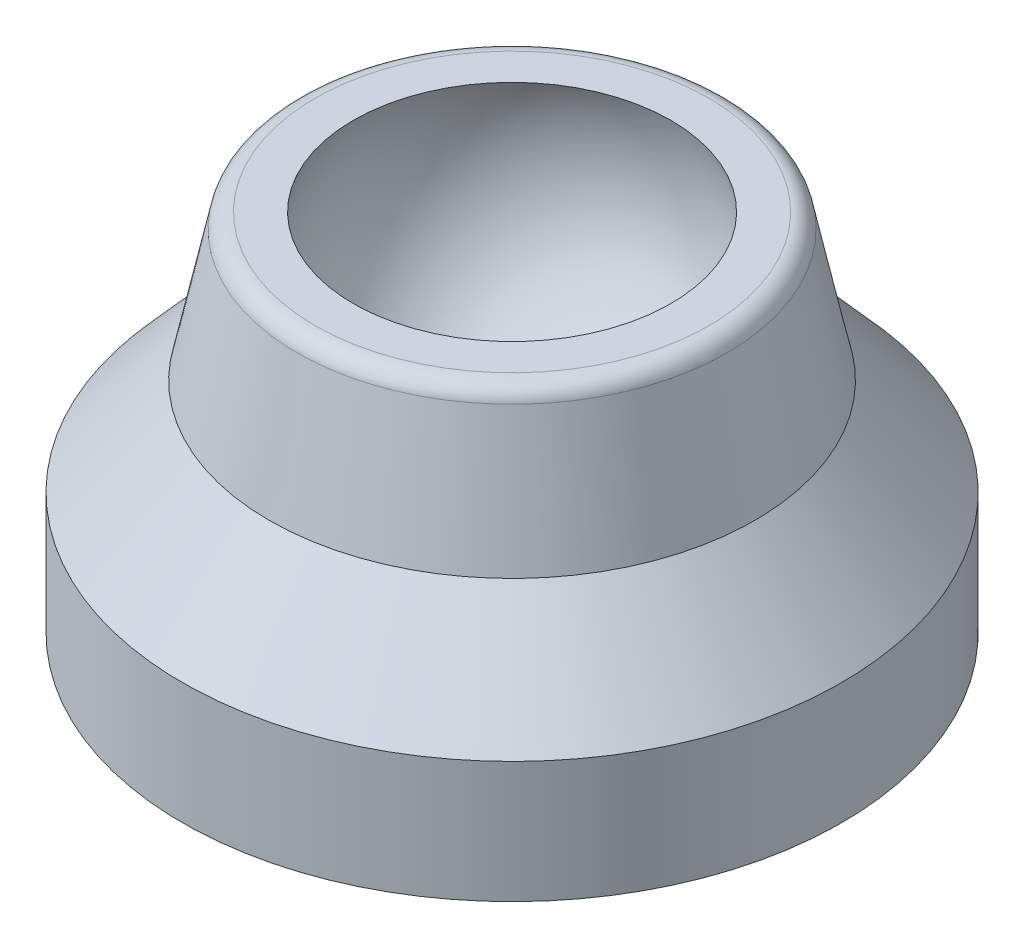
ISO-10303-21;
HEADER;
FILE_DESCRIPTION(('STEP AP214'),'2;1');
FILE_NAME('part.step','',(''),(''),'','','');
FILE_SCHEMA(('AUTOMOTIVE_DESIGN { 1 0 10303 214 1 1 1 1 }'));
ENDSEC;
DATA;
#1=APPLICATION_CONTEXT('core data for automotive mechanical design processes');
#2=APPLICATION_PROTOCOL_DEFINITION('international standard','automotive_design',2000,#1);
#3=PRODUCT_CONTEXT('',#1,'mechanical');
#4=PRODUCT('Part','Part','',(#3));
#5=PRODUCT_RELATED_PRODUCT_CATEGORY('part','',(#4));
#6=PRODUCT_DEFINITION_FORMATION('','',#4);
#7=PRODUCT_DEFINITION_CONTEXT('part definition',#1,'design');
#8=PRODUCT_DEFINITION('design','',#6,#7);
#9=PRODUCT_DEFINITION_SHAPE('','',#8);
#10=(LENGTH_UNIT() NAMED_UNIT(*) SI_UNIT(.MILLI.,.METRE.));
#11=(NAMED_UNIT(*) PLANE_ANGLE_UNIT() SI_UNIT($,.RADIAN.));
#12=(NAMED_UNIT(*) SI_UNIT($,.STERADIAN.) SOLID_ANGLE_UNIT());
#13=UNCERTAINTY_MEASURE_WITH_UNIT(LENGTH_MEASURE(1.E-05),#10,'distance_accuracy_value','');
#14=(GEOMETRIC_REPRESENTATION_CONTEXT(3) GLOBAL_UNCERTAINTY_ASSIGNED_CONTEXT((#13)) GLOBAL_UNIT_ASSIGNED_CONTEXT((#10,
#11,#12)) REPRESENTATION_CONTEXT('',''));
#15=CARTESIAN_POINT('',(0.,0.,0.));
#16=DIRECTION('',(0.,0.,1.));
#17=DIRECTION('',(1.,0.,0.));
#18=AXIS2_PLACEMENT_3D('',#15,#16,#17);
#19=CARTESIAN_POINT('',(0.,-5.25,0.));
#20=DIRECTION('',(0.,-1.,0.));
#21=DIRECTION('',(-1.,0.,0.));
#22=AXIS2_PLACEMENT_3D('',#19,#20,#21);
#23=SPHERICAL_SURFACE('',#22,4.9);
#24=CARTESIAN_POINT('',(0.,-3.5,0.));
#25=DIRECTION('',(0.,-1.,0.));
#26=DIRECTION('',(0.,0.,-1.));
#27=AXIS2_PLACEMENT_3D('',#24,#25,#26);
#28=CIRCLE('',#27,4.57684389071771);
#29=CARTESIAN_POINT('',(0.,-3.5,-4.57684389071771));
#30=VERTEX_POINT('',#29);
#31=EDGE_CURVE('E38',#30,#30,#28,.T.);
#32=ORIENTED_EDGE('',*,*,#31,.F.);
#33=EDGE_LOOP('',(#32));
#34=FACE_BOUND('',#33,.T.);
#35=ADVANCED_FACE('F15',(#34),#23,.F.);
#36=CARTESIAN_POINT('',(4.5768438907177,-3.5,0.));
#37=DIRECTION('',(0.,-1.,0.));
#38=DIRECTION('',(0.,0.,-1.));
#39=AXIS2_PLACEMENT_3D('',#36,#37,#38);
#40=PLANE('',#39);
#41=CARTESIAN_POINT('',(0.,-3.5,0.));
#42=DIRECTION('',(0.,-1.,0.));
#43=DIRECTION('',(0.,0.,-1.));
#44=AXIS2_PLACEMENT_3D('',#41,#42,#43);
#45=CIRCLE('',#44,5.67869842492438);
#46=CARTESIAN_POINT('',(0.,-3.5,-5.67869842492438));
#47=VERTEX_POINT('',#46);
#48=EDGE_CURVE('E35',#47,#47,#45,.T.);
#49=ORIENTED_EDGE('',*,*,#48,.F.);
#50=EDGE_LOOP('',(#49));
#51=FACE_BOUND('',#50,.T.);
#52=ORIENTED_EDGE('',*,*,#31,.T.);
#53=EDGE_LOOP('',(#52));
#54=FACE_BOUND('',#53,.T.);
#55=ADVANCED_FACE('F42',(#51,#54),#40,.F.);
#56=CARTESIAN_POINT('',(0.,-4.02999999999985,0.));
#57=DIRECTION('',(0.,-1.,0.));
#58=DIRECTION('',(0.,0.,-1.));
#59=AXIS2_PLACEMENT_3D('',#56,#57,#58);
#60=TOROIDAL_SURFACE('',#59,5.67869842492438,0.529999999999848);
#61=ORIENTED_EDGE('',*,*,#48,.T.);
#62=EDGE_LOOP('',(#61));
#63=FACE_BOUND('',#62,.T.);
#64=CARTESIAN_POINT('',(0.,-3.9198883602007,0.));
#65=DIRECTION('',(0.,-1.,0.));
#66=DIRECTION('',(0.,0.,-1.));
#67=AXIS2_PLACEMENT_3D('',#64,#65,#66);
#68=CIRCLE('',#67,6.1971339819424);
#69=CARTESIAN_POINT('',(0.,-3.9198883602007,-6.1971339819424));
#70=VERTEX_POINT('',#69);
#71=EDGE_CURVE('E30',#70,#70,#68,.T.);
#72=ORIENTED_EDGE('',*,*,#71,.F.);
#73=EDGE_LOOP('',(#72));
#74=FACE_BOUND('',#73,.T.);
#75=ADVANCED_FACE('F50',(#63,#74),#60,.T.);
#76=CARTESIAN_POINT('',(0.,-3.9198883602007,0.));
#77=DIRECTION('',(0.,-1.,0.));
#78=DIRECTION('',(0.,0.,-1.));
#79=AXIS2_PLACEMENT_3D('',#76,#77,#78);
#80=CONICAL_SURFACE('',#79,6.1971339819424,0.209282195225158);
#81=CARTESIAN_POINT('',(0.,-7.7,0.));
#82=DIRECTION('',(0.,-1.,0.));
#83=DIRECTION('',(0.,0.,-1.));
#84=AXIS2_PLACEMENT_3D('',#81,#82,#83);
#85=CIRCLE('',#84,7.);
#86=CARTESIAN_POINT('',(0.,-7.7,-7.));
#87=VERTEX_POINT('',#86);
#88=EDGE_CURVE('E26',#87,#87,#85,.T.);
#89=ORIENTED_EDGE('',*,*,#88,.F.);
#90=EDGE_LOOP('',(#89));
#91=FACE_BOUND('',#90,.T.);
#92=ORIENTED_EDGE('',*,*,#71,.T.);
#93=EDGE_LOOP('',(#92));
#94=FACE_BOUND('',#93,.T.);
#95=ADVANCED_FACE('F56',(#91,#94),#80,.T.);
#96=CARTESIAN_POINT('',(0.,-7.7,0.));
#97=DIRECTION('',(0.,-1.,0.));
#98=DIRECTION('',(0.,0.,-1.));
#99=AXIS2_PLACEMENT_3D('',#96,#97,#98);
#100=CONICAL_SURFACE('',#99,7.,0.72885472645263);
#101=CARTESIAN_POINT('',(0.,-10.5,0.));
#102=DIRECTION('',(0.,-1.,0.));
#103=DIRECTION('',(0.,0.,-1.));
#104=AXIS2_PLACEMENT_3D('',#101,#102,#103);
#105=CIRCLE('',#104,9.5);
#106=CARTESIAN_POINT('',(0.,-10.5,-9.5));
#107=VERTEX_POINT('',#106);
#108=EDGE_CURVE('E22',#107,#107,#105,.T.);
#109=ORIENTED_EDGE('',*,*,#108,.F.);
#110=EDGE_LOOP('',(#109));
#111=FACE_BOUND('',#110,.T.);
#112=ORIENTED_EDGE('',*,*,#88,.T.);
#113=EDGE_LOOP('',(#112));
#114=FACE_BOUND('',#113,.T.);
#115=ADVANCED_FACE('F60',(#111,#114),#100,.T.);
#116=CARTESIAN_POINT('',(0.,-14.,0.));
#117=DIRECTION('',(0.,-1.,0.));
#118=DIRECTION('',(0.,0.,-1.));
#119=AXIS2_PLACEMENT_3D('',#116,#117,#118);
#120=CYLINDRICAL_SURFACE('',#119,9.5);
#121=CARTESIAN_POINT('',(0.,-14.,0.));
#122=DIRECTION('',(0.,-1.,0.));
#123=DIRECTION('',(0.,0.,-1.));
#124=AXIS2_PLACEMENT_3D('',#121,#122,#123);
#125=CIRCLE('',#124,9.5);
#126=CARTESIAN_POINT('',(0.,-14.,-9.5));
#127=VERTEX_POINT('',#126);
#128=EDGE_CURVE('E10',#127,#127,#125,.T.);
#129=ORIENTED_EDGE('',*,*,#128,.F.);
#130=EDGE_LOOP('',(#129));
#131=FACE_BOUND('',#130,.T.);
#132=ORIENTED_EDGE('',*,*,#108,.T.);
#133=EDGE_LOOP('',(#132));
#134=FACE_BOUND('',#133,.T.);
#135=ADVANCED_FACE('F63',(#131,#134),#120,.T.);
#136=CARTESIAN_POINT('',(9.5,-14.,0.));
#137=DIRECTION('',(0.,1.,0.));
#138=DIRECTION('',(0.,0.,1.));
#139=AXIS2_PLACEMENT_3D('',#136,#137,#138);
#140=PLANE('',#139);
#141=ORIENTED_EDGE('',*,*,#128,.T.);
#142=EDGE_LOOP('',(#141));
#143=FACE_BOUND('',#142,.T.);
#144=ADVANCED_FACE('F17',(#143),#140,.F.);
#145=CLOSED_SHELL('',(#35,#55,#75,#95,#115,#135,#144));
#146=MANIFOLD_SOLID_BREP('B1',#145);
#147=ADVANCED_BREP_SHAPE_REPRESENTATION('',(#18,#146),#14);
#148=SHAPE_DEFINITION_REPRESENTATION(#9,#147);
ENDSEC;
END-ISO-10303-21;
